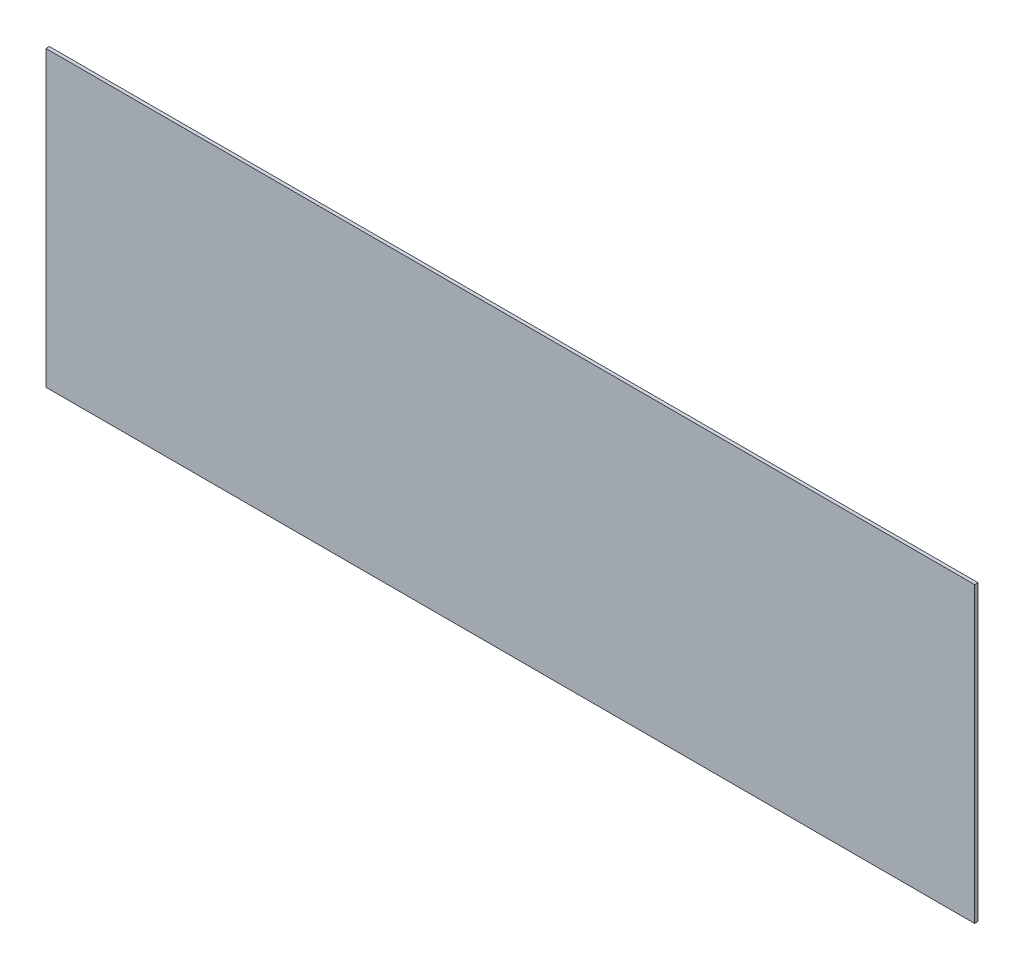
ISO-10303-21;
HEADER;
FILE_DESCRIPTION(('STEP AP214'),'2;1');
FILE_NAME('part.step','',(''),(''),'','','');
FILE_SCHEMA(('AUTOMOTIVE_DESIGN { 1 0 10303 214 1 1 1 1 }'));
ENDSEC;
DATA;
#1=APPLICATION_CONTEXT('core data for automotive mechanical design processes');
#2=APPLICATION_PROTOCOL_DEFINITION('international standard','automotive_design',2000,#1);
#3=PRODUCT_CONTEXT('',#1,'mechanical');
#4=PRODUCT('Part','Part','',(#3));
#5=PRODUCT_RELATED_PRODUCT_CATEGORY('part','',(#4));
#6=PRODUCT_DEFINITION_FORMATION('','',#4);
#7=PRODUCT_DEFINITION_CONTEXT('part definition',#1,'design');
#8=PRODUCT_DEFINITION('design','',#6,#7);
#9=PRODUCT_DEFINITION_SHAPE('','',#8);
#10=(LENGTH_UNIT() NAMED_UNIT(*) SI_UNIT(.MILLI.,.METRE.));
#11=(NAMED_UNIT(*) PLANE_ANGLE_UNIT() SI_UNIT($,.RADIAN.));
#12=(NAMED_UNIT(*) SI_UNIT($,.STERADIAN.) SOLID_ANGLE_UNIT());
#13=UNCERTAINTY_MEASURE_WITH_UNIT(LENGTH_MEASURE(1.E-05),#10,'distance_accuracy_value','');
#14=(GEOMETRIC_REPRESENTATION_CONTEXT(3) GLOBAL_UNCERTAINTY_ASSIGNED_CONTEXT((#13)) GLOBAL_UNIT_ASSIGNED_CONTEXT((#10,
#11,#12)) REPRESENTATION_CONTEXT('',''));
#15=CARTESIAN_POINT('',(0.,0.,0.));
#16=DIRECTION('',(0.,0.,1.));
#17=DIRECTION('',(1.,0.,0.));
#18=AXIS2_PLACEMENT_3D('',#15,#16,#17);
#19=CARTESIAN_POINT('',(0.,0.,2.032));
#20=DIRECTION('',(1.,0.,0.));
#21=DIRECTION('',(0.,0.,-1.));
#22=AXIS2_PLACEMENT_3D('',#19,#20,#21);
#23=PLANE('',#22);
#24=DIRECTION('',(0.,-1.,0.));
#25=VECTOR('',#24,1.);
#26=CARTESIAN_POINT('',(0.,0.,0.));
#27=LINE('',#26,#25);
#28=CARTESIAN_POINT('',(0.,177.8,0.));
#29=VERTEX_POINT('',#28);
#30=CARTESIAN_POINT('',(0.,0.,0.));
#31=VERTEX_POINT('',#30);
#32=EDGE_CURVE('E96',#29,#31,#27,.T.);
#33=ORIENTED_EDGE('',*,*,#32,.T.);
#34=DIRECTION('',(0.,0.,-1.));
#35=VECTOR('',#34,1.);
#36=CARTESIAN_POINT('',(0.,0.,2.032));
#37=LINE('',#36,#35);
#38=CARTESIAN_POINT('',(0.,0.,2.032));
#39=VERTEX_POINT('',#38);
#40=EDGE_CURVE('E11',#39,#31,#37,.T.);
#41=ORIENTED_EDGE('',*,*,#40,.F.);
#42=DIRECTION('',(0.,-1.,0.));
#43=VECTOR('',#42,1.);
#44=CARTESIAN_POINT('',(0.,0.,2.032));
#45=LINE('',#44,#43);
#46=CARTESIAN_POINT('',(0.,177.8,2.032));
#47=VERTEX_POINT('',#46);
#48=EDGE_CURVE('E84',#47,#39,#45,.T.);
#49=ORIENTED_EDGE('',*,*,#48,.F.);
#50=DIRECTION('',(0.,0.,-1.));
#51=VECTOR('',#50,1.);
#52=CARTESIAN_POINT('',(0.,177.8,2.032));
#53=LINE('',#52,#51);
#54=EDGE_CURVE('E92',#47,#29,#53,.T.);
#55=ORIENTED_EDGE('',*,*,#54,.T.);
#56=EDGE_LOOP('',(#33,#41,#49,#55));
#57=FACE_BOUND('',#56,.T.);
#58=ADVANCED_FACE('F33',(#57),#23,.F.);
#59=CARTESIAN_POINT('',(0.,0.,2.032));
#60=DIRECTION('',(0.,1.,0.));
#61=DIRECTION('',(0.,0.,1.));
#62=AXIS2_PLACEMENT_3D('',#59,#60,#61);
#63=PLANE('',#62);
#64=DIRECTION('',(1.,0.,0.));
#65=VECTOR('',#64,1.);
#66=CARTESIAN_POINT('',(0.,0.,0.));
#67=LINE('',#66,#65);
#68=CARTESIAN_POINT('',(562.61,0.,0.));
#69=VERTEX_POINT('',#68);
#70=EDGE_CURVE('E88',#31,#69,#67,.T.);
#71=ORIENTED_EDGE('',*,*,#70,.T.);
#72=DIRECTION('',(0.,0.,-1.));
#73=VECTOR('',#72,1.);
#74=CARTESIAN_POINT('',(562.61,0.,2.032));
#75=LINE('',#74,#73);
#76=CARTESIAN_POINT('',(562.61,0.,2.032));
#77=VERTEX_POINT('',#76);
#78=EDGE_CURVE('E41',#77,#69,#75,.T.);
#79=ORIENTED_EDGE('',*,*,#78,.F.);
#80=DIRECTION('',(1.,0.,0.));
#81=VECTOR('',#80,1.);
#82=CARTESIAN_POINT('',(0.,0.,2.032));
#83=LINE('',#82,#81);
#84=EDGE_CURVE('E79',#39,#77,#83,.T.);
#85=ORIENTED_EDGE('',*,*,#84,.F.);
#86=ORIENTED_EDGE('',*,*,#40,.T.);
#87=EDGE_LOOP('',(#71,#79,#85,#86));
#88=FACE_BOUND('',#87,.T.);
#89=ADVANCED_FACE('F87',(#88),#63,.F.);
#90=CARTESIAN_POINT('',(562.61,0.,2.032));
#91=DIRECTION('',(-1.,0.,0.));
#92=DIRECTION('',(0.,0.,1.));
#93=AXIS2_PLACEMENT_3D('',#90,#91,#92);
#94=PLANE('',#93);
#95=DIRECTION('',(0.,1.,0.));
#96=VECTOR('',#95,1.);
#97=CARTESIAN_POINT('',(562.61,0.,0.));
#98=LINE('',#97,#96);
#99=CARTESIAN_POINT('',(562.61,177.8,0.));
#100=VERTEX_POINT('',#99);
#101=EDGE_CURVE('E66',#69,#100,#98,.T.);
#102=ORIENTED_EDGE('',*,*,#101,.T.);
#103=DIRECTION('',(0.,0.,-1.));
#104=VECTOR('',#103,1.);
#105=CARTESIAN_POINT('',(562.61,177.8,2.032));
#106=LINE('',#105,#104);
#107=CARTESIAN_POINT('',(562.61,177.8,2.032));
#108=VERTEX_POINT('',#107);
#109=EDGE_CURVE('E89',#108,#100,#106,.T.);
#110=ORIENTED_EDGE('',*,*,#109,.F.);
#111=DIRECTION('',(0.,1.,0.));
#112=VECTOR('',#111,1.);
#113=CARTESIAN_POINT('',(562.61,0.,2.032));
#114=LINE('',#113,#112);
#115=EDGE_CURVE('E82',#77,#108,#114,.T.);
#116=ORIENTED_EDGE('',*,*,#115,.F.);
#117=ORIENTED_EDGE('',*,*,#78,.T.);
#118=EDGE_LOOP('',(#102,#110,#116,#117));
#119=FACE_BOUND('',#118,.T.);
#120=ADVANCED_FACE('F90',(#119),#94,.F.);
#121=CARTESIAN_POINT('',(0.,177.8,2.032));
#122=DIRECTION('',(0.,-1.,0.));
#123=DIRECTION('',(1.,0.,0.));
#124=AXIS2_PLACEMENT_3D('',#121,#122,#123);
#125=PLANE('',#124);
#126=DIRECTION('',(-1.,0.,0.));
#127=VECTOR('',#126,1.);
#128=CARTESIAN_POINT('',(0.,177.8,0.));
#129=LINE('',#128,#127);
#130=EDGE_CURVE('E72',#100,#29,#129,.T.);
#131=ORIENTED_EDGE('',*,*,#130,.T.);
#132=ORIENTED_EDGE('',*,*,#54,.F.);
#133=DIRECTION('',(-1.,0.,0.));
#134=VECTOR('',#133,1.);
#135=CARTESIAN_POINT('',(0.,177.8,2.032));
#136=LINE('',#135,#134);
#137=EDGE_CURVE('E49',#108,#47,#136,.T.);
#138=ORIENTED_EDGE('',*,*,#137,.F.);
#139=ORIENTED_EDGE('',*,*,#109,.T.);
#140=EDGE_LOOP('',(#131,#132,#138,#139));
#141=FACE_BOUND('',#140,.T.);
#142=ADVANCED_FACE('F103',(#141),#125,.F.);
#143=CARTESIAN_POINT('',(0.,0.,2.032));
#144=DIRECTION('',(0.,0.,-1.));
#145=DIRECTION('',(-1.,0.,0.));
#146=AXIS2_PLACEMENT_3D('',#143,#144,#145);
#147=PLANE('',#146);
#148=ORIENTED_EDGE('',*,*,#48,.T.);
#149=ORIENTED_EDGE('',*,*,#84,.T.);
#150=ORIENTED_EDGE('',*,*,#115,.T.);
#151=ORIENTED_EDGE('',*,*,#137,.T.);
#152=EDGE_LOOP('',(#148,#149,#150,#151));
#153=FACE_BOUND('',#152,.T.);
#154=ADVANCED_FACE('F80',(#153),#147,.F.);
#155=CARTESIAN_POINT('',(0.,0.,0.));
#156=DIRECTION('',(0.,0.,-1.));
#157=DIRECTION('',(-1.,0.,0.));
#158=AXIS2_PLACEMENT_3D('',#155,#156,#157);
#159=PLANE('',#158);
#160=ORIENTED_EDGE('',*,*,#32,.F.);
#161=ORIENTED_EDGE('',*,*,#130,.F.);
#162=ORIENTED_EDGE('',*,*,#101,.F.);
#163=ORIENTED_EDGE('',*,*,#70,.F.);
#164=EDGE_LOOP('',(#160,#161,#162,#163));
#165=FACE_BOUND('',#164,.T.);
#166=ADVANCED_FACE('F106',(#165),#159,.T.);
#167=CLOSED_SHELL('',(#58,#89,#120,#142,#154,#166));
#168=MANIFOLD_SOLID_BREP('B2',#167);
#169=ADVANCED_BREP_SHAPE_REPRESENTATION('',(#18,#168),#14);
#170=SHAPE_DEFINITION_REPRESENTATION(#9,#169);
ENDSEC;
END-ISO-10303-21;
